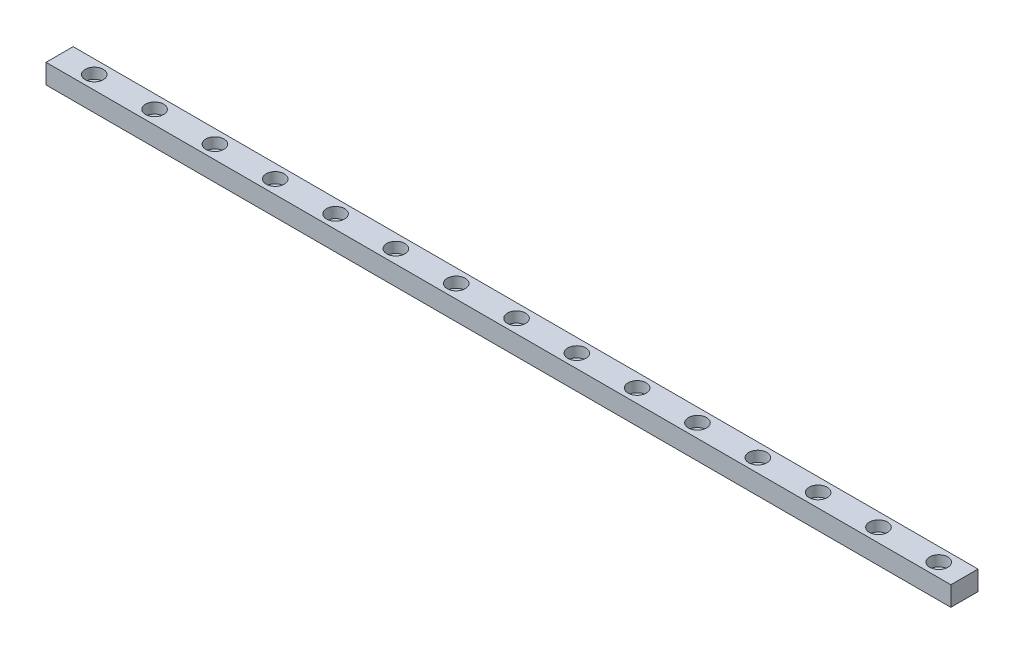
from build123d import *

# Parameters (mm, degrees)
SKETCH1_W           = 9
SKETCH1_H           = 6.5
BOSS_EXTRUDE1_DEPTH = 150
SKETCH2_R           = 1.5
CUT_EXTRUDE1_DEPTH  = 151.208188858
SKETCH3_R           = 3
CUT_EXTRUDE2_DEPTH  = 3.5


with BuildPart() as part:
    # Sketch1 → Boss-Extrude1 (new, symmetric)
    with BuildSketch(Plane(origin=(0, 0, 0), x_dir=(0, 0, -1), z_dir=(1, 0, 0))):
        with Locations((0, -3.25)):
            Rectangle(SKETCH1_W, SKETCH1_H)
    extrude(amount=BOSS_EXTRUDE1_DEPTH, both=True)

    # Sketch2 → Cut-Extrude1 (cut, through all)
    with BuildSketch(Plane(origin=(0, 0, 0), x_dir=(1, 0, 0), z_dir=(0, 1, 0))):
        with Locations(Location((-138.5, 0, 0), (0, 0, 270))):
            Circle(SKETCH2_R)
        with Locations(Location((-118.5, 0, 0), (0, 0, 270))):
            Circle(SKETCH2_R)
        with Locations(Location((-98.5, 0, 0), (0, 0, 270))):
            Circle(SKETCH2_R)
        with Locations(Location((-78.5, 0, 0), (0, 0, 270))):
            Circle(SKETCH2_R)
        with Locations(Location((-58.5, 0, 0), (0, 0, 270))):
            Circle(SKETCH2_R)
        with Locations(Location((-38.5, 0, 0), (0, 0, 270))):
            Circle(SKETCH2_R)
        with Locations(Location((-18.5, 0, 0), (0, 0, 270))):
            Circle(SKETCH2_R)
        with Locations(Location((1.5, 0, 0), (0, 0, 270))):
            Circle(SKETCH2_R)
        with Locations(Location((21.5, 0, 0), (0, 0, 270))):
            Circle(SKETCH2_R)
        with Locations(Location((41.5, 0, 0), (0, 0, 270))):
            Circle(SKETCH2_R)
        with Locations(Location((61.5, 0, 0), (0, 0, 270))):
            Circle(SKETCH2_R)
        with Locations(Location((81.5, 0, 0), (0, 0, 270))):
            Circle(SKETCH2_R)
        with Locations(Location((101.5, 0, 0), (0, 0, 270))):
            Circle(SKETCH2_R)
        with Locations(Location((121.5, 0, 0), (0, 0, 270))):
            Circle(SKETCH2_R)
        with Locations(Location((141.5, 0, 0), (0, 0, 270))):
            Circle(SKETCH2_R)
    extrude(amount=-CUT_EXTRUDE1_DEPTH, mode=Mode.SUBTRACT)

    # Sketch3 → Cut-Extrude2 (cut)
    with BuildSketch(Plane(origin=(0, 0, 0), x_dir=(1, 0, 0), z_dir=(0, 1, 0))):
        with Locations(Location((-138.5, 0, 0), (0, 0, 270))):
            Circle(SKETCH3_R)
        with Locations(Location((-118.5, 0, 0), (0, 0, 270))):
            Circle(SKETCH3_R)
        with Locations(Location((-98.5, 0, 0), (0, 0, 270))):
            Circle(SKETCH3_R)
        with Locations(Location((-78.5, 0, 0), (0, 0, 270))):
            Circle(SKETCH3_R)
        with Locations(Location((-58.5, 0, 0), (0, 0, 270))):
            Circle(SKETCH3_R)
        with Locations(Location((-38.5, 0, 0), (0, 0, 270))):
            Circle(SKETCH3_R)
        with Locations(Location((-18.5, 0, 0), (0, 0, 270))):
            Circle(SKETCH3_R)
        with Locations(Location((1.5, 0, 0), (0, 0, 270))):
            Circle(SKETCH3_R)
        with Locations(Location((21.5, 0, 0), (0, 0, 270))):
            Circle(SKETCH3_R)
        with Locations(Location((41.5, 0, 0), (0, 0, 270))):
            Circle(SKETCH3_R)
        with Locations(Location((61.5, 0, 0), (0, 0, 270))):
            Circle(SKETCH3_R)
        with Locations(Location((81.5, 0, 0), (0, 0, 270))):
            Circle(SKETCH3_R)
        with Locations(Location((101.5, 0, 0), (0, 0, 270))):
            Circle(SKETCH3_R)
        with Locations(Location((121.5, 0, 0), (0, 0, 270))):
            Circle(SKETCH3_R)
        with Locations(Location((141.5, 0, 0), (0, 0, 270))):
            Circle(SKETCH3_R)
    extrude(amount=-CUT_EXTRUDE2_DEPTH, mode=Mode.SUBTRACT)


solid = part.part
